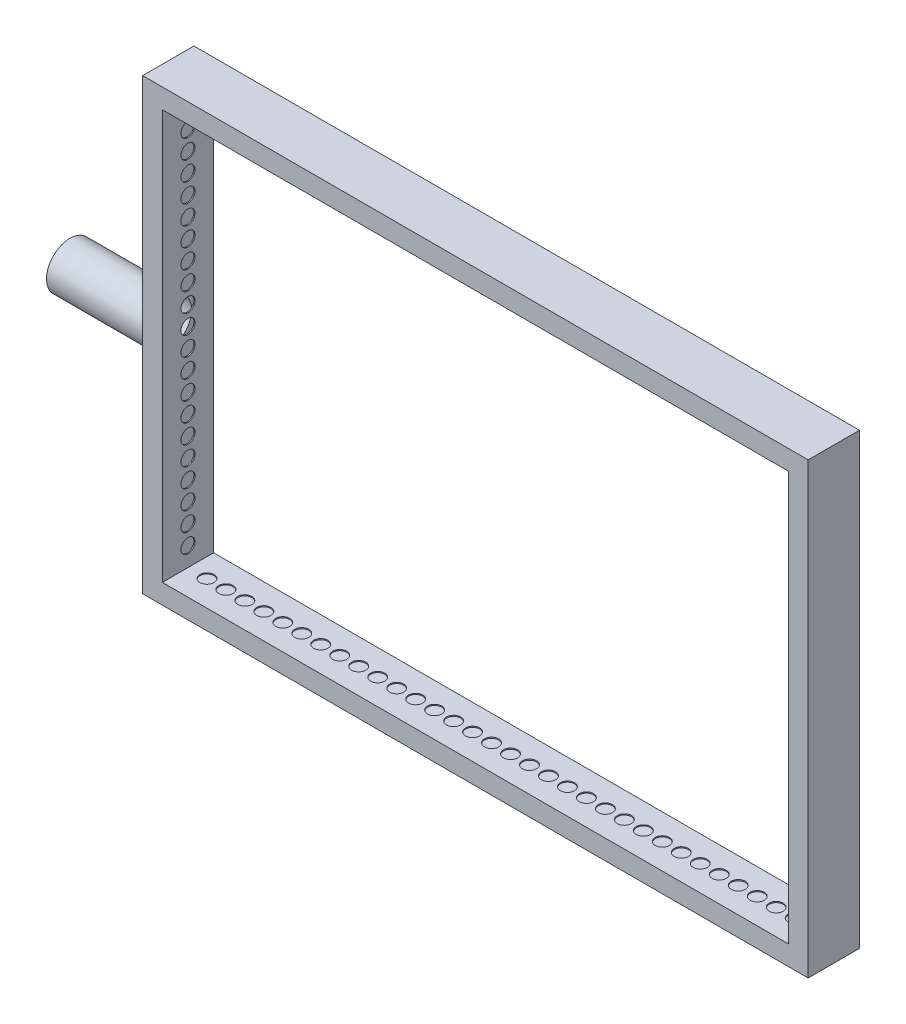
from build123d import *

# Parameters (mm, degrees)
CROQUIS1_W              = 947
CROQUIS1_H              = 638.5
CROQUIS1_W_2            = 891
CROQUIS1_H_2            = 582.5
SALIENTE_EXTRUIR1_DEPTH = 73
CROQUIS2_W              = 944
CROQUIS2_H              = 635.5
CROQUIS2_W_2            = 894
CROQUIS2_H_2            = 585.5
CORTAR_EXTRUIR2_DEPTH   = 35
CROQUIS5_R              = 10
CORTAR_EXTRUIR4_DEPTH   = 1.5
CROQUIS6_R              = 10
CORTAR_EXTRUIR5_DEPTH   = 1.5
CROQUIS7_R              = 10
CORTAR_EXTRUIR6_DEPTH   = 1.5
CROQUIS8_R              = 10
CORTAR_EXTRUIR7_DEPTH   = 1.5
CORTAR_EXTRUIR8_START   = -1.5
CROQUIS9_R              = 10
CORTAR_EXTRUIR8_DEPTH   = 1.5
CORTAR_EXTRUIR9_START   = -1.5
CROQUIS10_R             = 10
CORTAR_EXTRUIR9_DEPTH   = 1.5
CROQUIS11_R             = 33.25
SALIENTE_EXTRUIR2_DEPTH = 140
CORTAR_EXTRUIR10_REACH  = 1264.767
CROQUIS13_R             = 31.75
CROQUIS14_W             = 10.295101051
CROQUIS14_H             = 82.360808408
SALIENTE_EXTRUIR3_DEPTH = 5


with BuildPart() as part:
    # Croquis1 → Saliente-Extruir1 (new body)
    with BuildSketch(Plane.XY):
        with Locations((473.5, 319.25)):
            Rectangle(CROQUIS1_W, CROQUIS1_H)
        with Locations((473.5, 319.25)):
            Rectangle(CROQUIS1_W_2, CROQUIS1_H_2, mode=Mode.SUBTRACT)
    extrude(amount=SALIENTE_EXTRUIR1_DEPTH)

    # Croquis2 → Cortar-Extruir2 (cut, symmetric)
    with BuildSketch(Plane.XY.offset(36.5)):
        with Locations((473.5, 319.25)):
            Rectangle(CROQUIS2_W, CROQUIS2_H)
        with Locations((473.5, 319.25)):
            Rectangle(CROQUIS2_W_2, CROQUIS2_H_2, mode=Mode.SUBTRACT)
    extrude(amount=CORTAR_EXTRUIR2_DEPTH, both=True, mode=Mode.SUBTRACT)

    # Croquis5 → Cortar-Extruir4 (cut)
    with BuildSketch(Plane(origin=(0, 28, 0), x_dir=(1, 0, 0), z_dir=(0, 1, 0))):
        with Locations(Location((55, -36.5, 0), (0, 0, 270))):
            Circle(CROQUIS5_R)
    extrude(amount=-CORTAR_EXTRUIR4_DEPTH, mode=Mode.SUBTRACT)

    # Croquis6 → Cortar-Extruir5 (cut)
    with BuildSketch(Plane(origin=(0, 28, 0), x_dir=(1, 0, 0), z_dir=(0, 1, 0))):
        with Locations(Location((82, -36.5, 0), (0, 0, 270))):
            Circle(CROQUIS6_R)
        with Locations(Location((109, -36.5, 0), (0, 0, 270))):
            Circle(CROQUIS6_R)
        with Locations(Location((136, -36.5, 0), (0, 0, 270))):
            Circle(CROQUIS6_R)
        with Locations(Location((163, -36.5, 0), (0, 0, 270))):
            Circle(CROQUIS6_R)
        with Locations(Location((190, -36.5, 0), (0, 0, 270))):
            Circle(CROQUIS6_R)
        with Locations(Location((217, -36.5, 0), (0, 0, 270))):
            Circle(CROQUIS6_R)
        with Locations(Location((244, -36.5, 0), (0, 0, 270))):
            Circle(CROQUIS6_R)
        with Locations(Location((271, -36.5, 0), (0, 0, 270))):
            Circle(CROQUIS6_R)
        with Locations(Location((298, -36.5, 0), (0, 0, 270))):
            Circle(CROQUIS6_R)
        with Locations(Location((325, -36.5, 0), (0, 0, 270))):
            Circle(CROQUIS6_R)
        with Locations(Location((352, -36.5, 0), (0, 0, 270))):
            Circle(CROQUIS6_R)
        with Locations(Location((379, -36.5, 0), (0, 0, 270))):
            Circle(CROQUIS6_R)
        with Locations(Location((406, -36.5, 0), (0, 0, 270))):
            Circle(CROQUIS6_R)
        with Locations(Location((433, -36.5, 0), (0, 0, 270))):
            Circle(CROQUIS6_R)
        with Locations(Location((460, -36.5, 0), (0, 0, 270))):
            Circle(CROQUIS6_R)
        with Locations(Location((487, -36.5, 0), (0, 0, 270))):
            Circle(CROQUIS6_R)
        with Locations(Location((514, -36.5, 0), (0, 0, 270))):
            Circle(CROQUIS6_R)
        with Locations(Location((541, -36.5, 0), (0, 0, 270))):
            Circle(CROQUIS6_R)
        with Locations(Location((568, -36.5, 0), (0, 0, 270))):
            Circle(CROQUIS6_R)
        with Locations(Location((595, -36.5, 0), (0, 0, 270))):
            Circle(CROQUIS6_R)
        with Locations(Location((622, -36.5, 0), (0, 0, 270))):
            Circle(CROQUIS6_R)
        with Locations(Location((649, -36.5, 0), (0, 0, 270))):
            Circle(CROQUIS6_R)
        with Locations(Location((676, -36.5, 0), (0, 0, 270))):
            Circle(CROQUIS6_R)
        with Locations(Location((703, -36.5, 0), (0, 0, 270))):
            Circle(CROQUIS6_R)
        with Locations(Location((730, -36.5, 0), (0, 0, 270))):
            Circle(CROQUIS6_R)
        with Locations(Location((757, -36.5, 0), (0, 0, 270))):
            Circle(CROQUIS6_R)
        with Locations(Location((784, -36.5, 0), (0, 0, 270))):
            Circle(CROQUIS6_R)
        with Locations(Location((811, -36.5, 0), (0, 0, 270))):
            Circle(CROQUIS6_R)
        with Locations(Location((838, -36.5, 0), (0, 0, 270))):
            Circle(CROQUIS6_R)
        with Locations(Location((865, -36.5, 0), (0, 0, 270))):
            Circle(CROQUIS6_R)
        with Locations(Location((892, -36.5, 0), (0, 0, 270))):
            Circle(CROQUIS6_R)
    extrude(amount=-CORTAR_EXTRUIR5_DEPTH, mode=Mode.SUBTRACT)

    # Croquis7 → Cortar-Extruir6 (cut)
    with BuildSketch(Plane(origin=(28, 0, 0), x_dir=(0, 0, -1), z_dir=(1, 0, 0))):
        with Locations((-36.5, 55)):
            Circle(CROQUIS7_R)
    extrude(amount=-CORTAR_EXTRUIR6_DEPTH, mode=Mode.SUBTRACT)

    # Croquis8 → Cortar-Extruir7 (cut)
    with BuildSketch(Plane(origin=(28, 0, 0), x_dir=(0, 0, -1), z_dir=(1, 0, 0))):
        with Locations((-36.5, 82)):
            Circle(CROQUIS8_R)
        with Locations((-36.5, 109)):
            Circle(CROQUIS8_R)
        with Locations((-36.5, 136)):
            Circle(CROQUIS8_R)
        with Locations((-36.5, 163)):
            Circle(CROQUIS8_R)
        with Locations((-36.5, 190)):
            Circle(CROQUIS8_R)
        with Locations((-36.5, 217)):
            Circle(CROQUIS8_R)
        with Locations((-36.5, 244)):
            Circle(CROQUIS8_R)
        with Locations((-36.5, 271)):
            Circle(CROQUIS8_R)
        with Locations((-36.5, 298)):
            Circle(CROQUIS8_R)
        with Locations((-36.5, 325)):
            Circle(CROQUIS8_R)
        with Locations((-36.5, 352)):
            Circle(CROQUIS8_R)
        with Locations((-36.5, 379)):
            Circle(CROQUIS8_R)
        with Locations((-36.5, 406)):
            Circle(CROQUIS8_R)
        with Locations((-36.5, 433)):
            Circle(CROQUIS8_R)
        with Locations((-36.5, 460)):
            Circle(CROQUIS8_R)
        with Locations((-36.5, 487)):
            Circle(CROQUIS8_R)
        with Locations((-36.5, 514)):
            Circle(CROQUIS8_R)
        with Locations((-36.5, 541)):
            Circle(CROQUIS8_R)
        with Locations((-36.5, 568)):
            Circle(CROQUIS8_R)
        with Locations((-36.5, 595)):
            Circle(CROQUIS8_R)
    extrude(amount=-CORTAR_EXTRUIR7_DEPTH, mode=Mode.SUBTRACT)

    # Croquis9 → Cortar-Extruir8 (cut)
    with BuildSketch(Plane.ZY.offset(-919).offset(CORTAR_EXTRUIR8_START)):
        with Locations(Location((36.5, 55, 0), (0, 0, 180))):
            Circle(CROQUIS9_R)
        with Locations(Location((36.5, 82, 0), (0, 0, 180))):
            Circle(CROQUIS9_R)
        with Locations(Location((36.5, 109, 0), (0, 0, 180))):
            Circle(CROQUIS9_R)
        with Locations(Location((36.5, 136, 0), (0, 0, 180))):
            Circle(CROQUIS9_R)
        with Locations(Location((36.5, 163, 0), (0, 0, 180))):
            Circle(CROQUIS9_R)
        with Locations(Location((36.5, 190, 0), (0, 0, 180))):
            Circle(CROQUIS9_R)
        with Locations(Location((36.5, 217, 0), (0, 0, 180))):
            Circle(CROQUIS9_R)
        with Locations(Location((36.5, 244, 0), (0, 0, 180))):
            Circle(CROQUIS9_R)
        with Locations(Location((36.5, 271, 0), (0, 0, 180))):
            Circle(CROQUIS9_R)
        with Locations(Location((36.5, 298, 0), (0, 0, 180))):
            Circle(CROQUIS9_R)
        with Locations(Location((36.5, 325, 0), (0, 0, 180))):
            Circle(CROQUIS9_R)
        with Locations(Location((36.5, 352, 0), (0, 0, 180))):
            Circle(CROQUIS9_R)
        with Locations(Location((36.5, 379, 0), (0, 0, 180))):
            Circle(CROQUIS9_R)
        with Locations(Location((36.5, 406, 0), (0, 0, 180))):
            Circle(CROQUIS9_R)
        with Locations(Location((36.5, 433, 0), (0, 0, 180))):
            Circle(CROQUIS9_R)
        with Locations(Location((36.5, 460, 0), (0, 0, 180))):
            Circle(CROQUIS9_R)
        with Locations(Location((36.5, 487, 0), (0, 0, 180))):
            Circle(CROQUIS9_R)
        with Locations(Location((36.5, 514, 0), (0, 0, 180))):
            Circle(CROQUIS9_R)
        with Locations(Location((36.5, 541, 0), (0, 0, 180))):
            Circle(CROQUIS9_R)
        with Locations(Location((36.5, 568, 0), (0, 0, 180))):
            Circle(CROQUIS9_R)
        with Locations(Location((36.5, 595, 0), (0, 0, 180))):
            Circle(CROQUIS9_R)
    extrude(amount=CORTAR_EXTRUIR8_DEPTH, mode=Mode.SUBTRACT)

    # Croquis10 → Cortar-Extruir9 (cut)
    with BuildSketch(Plane.XZ.offset(-610.5).offset(CORTAR_EXTRUIR9_START)):
        with Locations(Location((892, 36.5, 0), (0, 0, 90))):
            Circle(CROQUIS10_R)
        with Locations(Location((865, 36.5, 0), (0, 0, 90))):
            Circle(CROQUIS10_R)
        with Locations(Location((838, 36.5, 0), (0, 0, 90))):
            Circle(CROQUIS10_R)
        with Locations(Location((811, 36.5, 0), (0, 0, 90))):
            Circle(CROQUIS10_R)
        with Locations(Location((784, 36.5, 0), (0, 0, 90))):
            Circle(CROQUIS10_R)
        with Locations(Location((757, 36.5, 0), (0, 0, 90))):
            Circle(CROQUIS10_R)
        with Locations(Location((730, 36.5, 0), (0, 0, 90))):
            Circle(CROQUIS10_R)
        with Locations(Location((703, 36.5, 0), (0, 0, 90))):
            Circle(CROQUIS10_R)
        with Locations(Location((676, 36.5, 0), (0, 0, 90))):
            Circle(CROQUIS10_R)
        with Locations(Location((649, 36.5, 0), (0, 0, 90))):
            Circle(CROQUIS10_R)
        with Locations(Location((622, 36.5, 0), (0, 0, 90))):
            Circle(CROQUIS10_R)
        with Locations(Location((595, 36.5, 0), (0, 0, 90))):
            Circle(CROQUIS10_R)
        with Locations(Location((568, 36.5, 0), (0, 0, 90))):
            Circle(CROQUIS10_R)
        with Locations(Location((541, 36.5, 0), (0, 0, 90))):
            Circle(CROQUIS10_R)
        with Locations(Location((514, 36.5, 0), (0, 0, 90))):
            Circle(CROQUIS10_R)
        with Locations(Location((487, 36.5, 0), (0, 0, 90))):
            Circle(CROQUIS10_R)
        with Locations(Location((460, 36.5, 0), (0, 0, 90))):
            Circle(CROQUIS10_R)
        with Locations(Location((433, 36.5, 0), (0, 0, 90))):
            Circle(CROQUIS10_R)
        with Locations(Location((406, 36.5, 0), (0, 0, 90))):
            Circle(CROQUIS10_R)
        with Locations(Location((379, 36.5, 0), (0, 0, 90))):
            Circle(CROQUIS10_R)
        with Locations(Location((352, 36.5, 0), (0, 0, 90))):
            Circle(CROQUIS10_R)
        with Locations(Location((325, 36.5, 0), (0, 0, 90))):
            Circle(CROQUIS10_R)
        with Locations(Location((298, 36.5, 0), (0, 0, 90))):
            Circle(CROQUIS10_R)
        with Locations(Location((271, 36.5, 0), (0, 0, 90))):
            Circle(CROQUIS10_R)
        with Locations(Location((244, 36.5, 0), (0, 0, 90))):
            Circle(CROQUIS10_R)
        with Locations(Location((217, 36.5, 0), (0, 0, 90))):
            Circle(CROQUIS10_R)
        with Locations(Location((190, 36.5, 0), (0, 0, 90))):
            Circle(CROQUIS10_R)
        with Locations(Location((163, 36.5, 0), (0, 0, 90))):
            Circle(CROQUIS10_R)
        with Locations(Location((136, 36.5, 0), (0, 0, 90))):
            Circle(CROQUIS10_R)
        with Locations(Location((109, 36.5, 0), (0, 0, 90))):
            Circle(CROQUIS10_R)
        with Locations(Location((82, 36.5, 0), (0, 0, 90))):
            Circle(CROQUIS10_R)
        with Locations(Location((55, 36.5, 0), (0, 0, 90))):
            Circle(CROQUIS10_R)
    extrude(amount=CORTAR_EXTRUIR9_DEPTH, mode=Mode.SUBTRACT)

    # Croquis11 → Saliente-Extruir2 (add)
    with BuildSketch(Plane.ZY):
        with Locations(Location((36.5, 316.5, 0), (0, 0, 180))):
            Circle(CROQUIS11_R)
    extrude(amount=SALIENTE_EXTRUIR2_DEPTH)

    # Croquis13 → Cortar-Extruir10 (cut, up to next)
    with BuildSketch(Plane.ZY.offset(140), mode=Mode.PRIVATE) as cortar_extruir10_sk1:
        with Locations((36.5, 316.5)):
            Circle(CROQUIS13_R)
    cortar_extruir10_tool1 = extrude(cortar_extruir10_sk1.sketch, amount=-CORTAR_EXTRUIR10_REACH, mode=Mode.PRIVATE) & part.part
    add(cortar_extruir10_tool1.solids().sort_by_distance((-140, 316.5, 36.5))[0], mode=Mode.SUBTRACT)

    # Croquis14 → Saliente-Extruir3 (add)
    with BuildSketch(Plane.ZY):
        with Locations((35.590404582, 444.135586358)):
            Rectangle(CROQUIS14_W, CROQUIS14_H)
    extrude(amount=SALIENTE_EXTRUIR3_DEPTH)


solid = part.part
